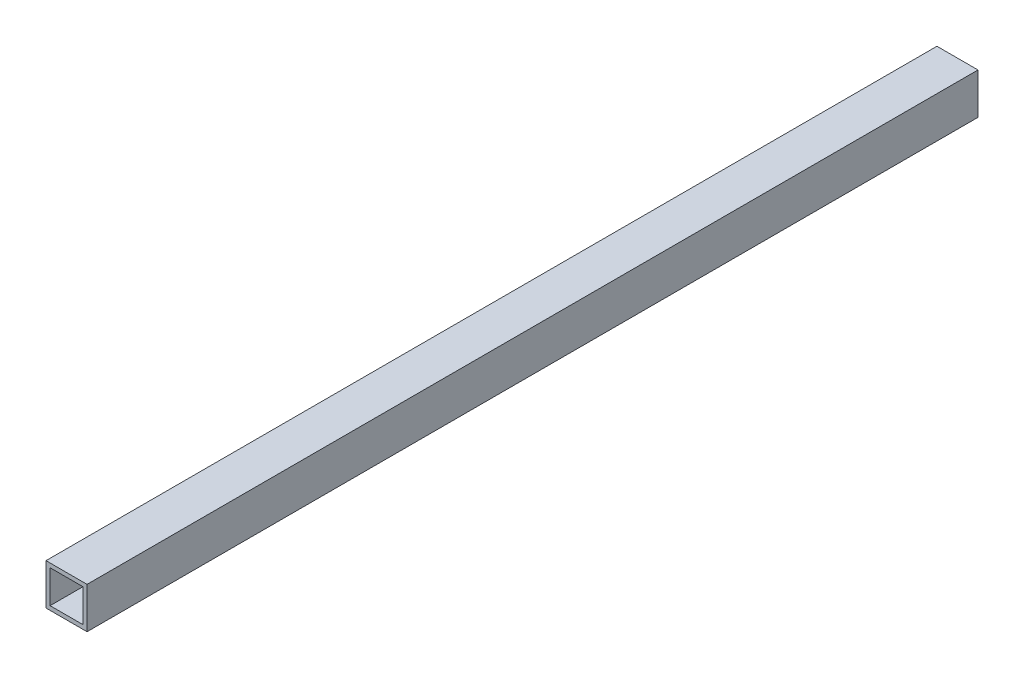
from build123d import *

# Parameters (mm, degrees)
ESQUISSE1_W        = 10
ESQUISSE1_H        = 10
ESQUISSE1_W_2      = 8
ESQUISSE1_H_2      = 8
BOSS_EXTRU_2_DEPTH = 217


with BuildPart() as part:
    # Esquisse1 → Boss.-Extru.2 (new body)
    with BuildSketch(Plane.XY):
        with Locations((0.080613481, 1.217148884)):
            Rectangle(ESQUISSE1_W, ESQUISSE1_H)
        with Locations((0.080613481, 1.217148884)):
            Rectangle(ESQUISSE1_W_2, ESQUISSE1_H_2, mode=Mode.SUBTRACT)
    extrude(amount=BOSS_EXTRU_2_DEPTH)


solid = part.part
